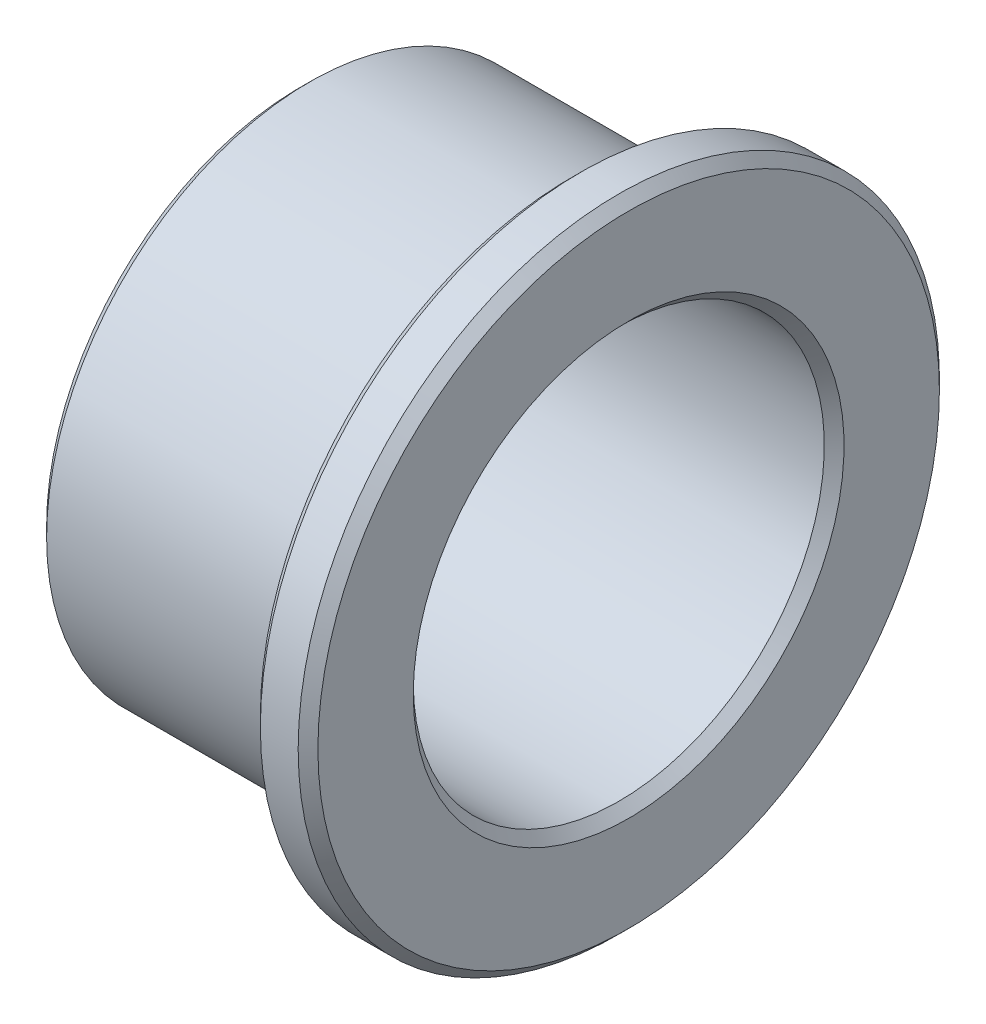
from build123d import *


with BuildPart() as part:
    # Esquisse1 → Base-R_volution (revolve)
    with BuildSketch(Plane.XY, mode=Mode.PRIVATE) as base_r_volution_sk:
        with BuildLine():
            Line((0, 13.1), (0, 15.4))
            Line((0, 15.4), (0.6, 16))
            Line((0.6, 16), (15.9, 16))
            ThreePointArc((15.9, 16), (16.324264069, 16.175735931), (16.5, 16.6))
            Line((16.5, 16.6), (16.5, 18.9))
            Line((16.5, 18.9), (17.1, 19.5))
            Line((17.1, 19.5), (19.4, 19.5))
            Line((19.4, 19.5), (20, 18.9))
            Line((20, 18.9), (20, 13.1))
            Line((20, 13.1), (19.4, 12.5))
            Line((19.4, 12.5), (0.6, 12.5))
            Line((0.6, 12.5), (0, 13.1))
        make_face()
    revolve(base_r_volution_sk.sketch.rotate(Axis((0, 0, 0), (1, 0, 0)), 90), axis=Axis((0, 0, 0), (1, 0, 0)))


solid = part.part
